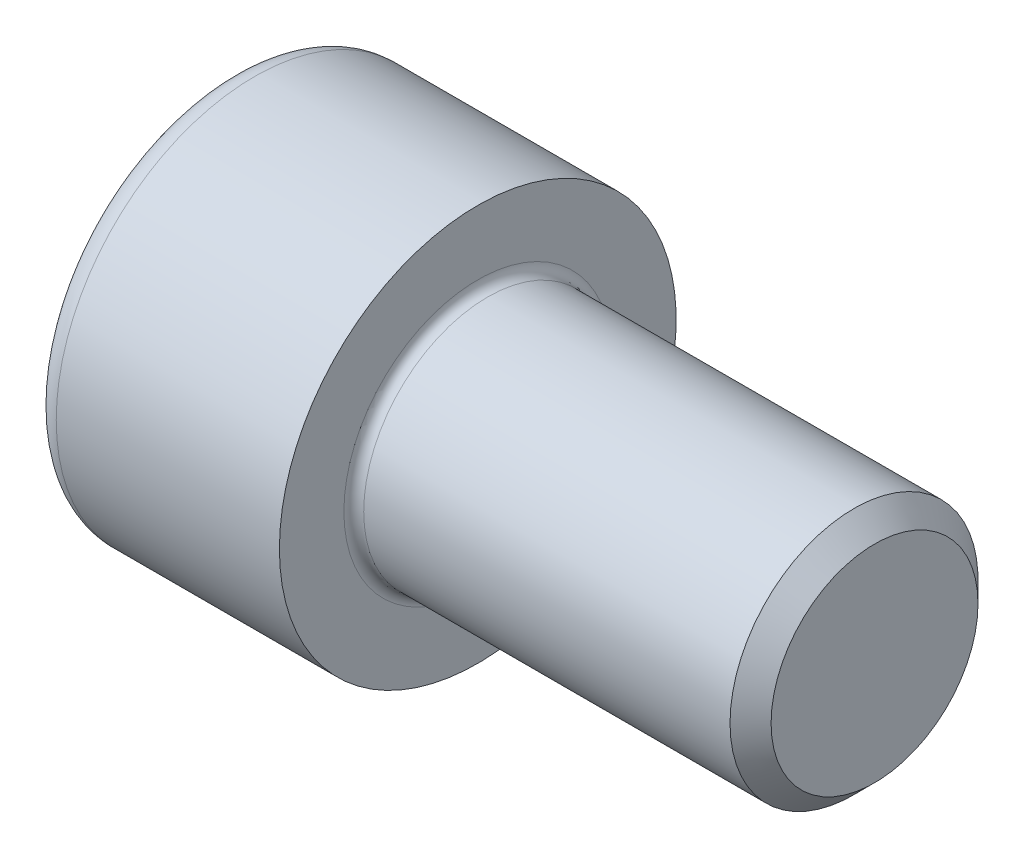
from build123d import *

# Parameters (mm, degrees)
FILLET1_R   = 0.4
FILLET2_R   = 1
HEX_2_DEPTH = 5


with BuildPart() as part:
    # BodySke → Base-Revolve (revolve)
    with BuildSketch(Plane.XY, mode=Mode.PRIVATE) as base_revolve_sk:
        Polygon((0, 0), (0, 8), (10, 8), (10, 5), (25.172, 5), (26, 4.172), (26, 0), align=None)
    revolve(base_revolve_sk.sketch.rotate(Axis((-31.75, 0, 0), (1, 0, 0)), 90), axis=Axis((-31.75, 0, 0), (1, 0, 0)))

    # Fillet1
    fillet1_edges = [part.edges().sort_by_distance(p)[0] for p in [
        (10, 0, -5),
    ]]
    fillet(fillet1_edges, radius=FILLET1_R)

    # Fillet2
    fillet2_edges = [part.edges().sort_by_distance(p)[0] for p in [
        (0, 0, -8),
    ]]
    fillet(fillet2_edges, radius=FILLET2_R)

    # Sketch2 → Hex-PreBroach (revolve, cut)
    with BuildSketch(Plane.XY, mode=Mode.PRIVATE) as hex_prebroach_sk:
        Polygon((0, 4.0125), (5, 4.0125), (7.316617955, 0), (0, 0), align=None)
    revolve(hex_prebroach_sk.sketch.rotate(Axis((0, 0, 0), (1, 0, 0)), 90), axis=Axis((0, 0, 0), (1, 0, 0)), mode=Mode.SUBTRACT)

    # Sketch3 → Hex 2 (cut)
    with BuildSketch(Plane(origin=(0, 0, 0), x_dir=(0, 0.500000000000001, 0.866025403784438), z_dir=(-1, 0, 0))):
        Polygon((2.316617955, 4.0125), (-2.316617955, 4.0125), (-4.63323591, 0), (-2.316617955, -4.0125), (2.316617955, -4.0125), (4.63323591, 0), align=None)
    extrude(amount=-HEX_2_DEPTH, mode=Mode.SUBTRACT)


solid = part.part
